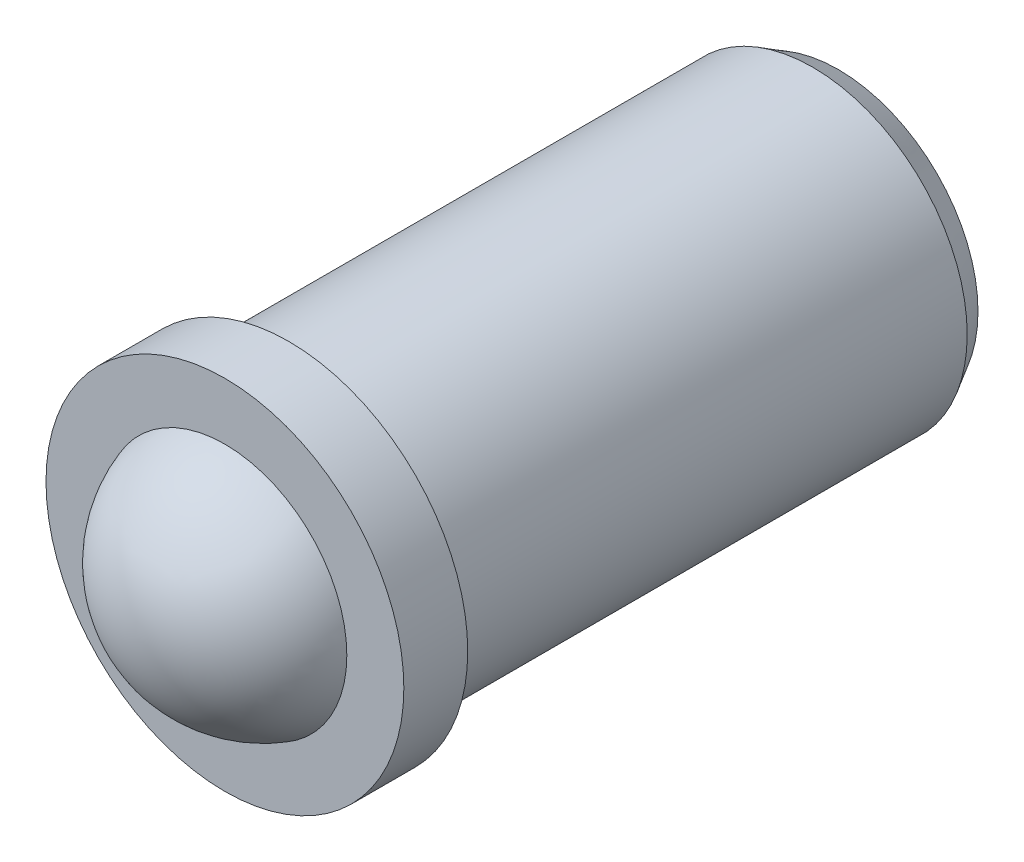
ISO-10303-21;
HEADER;
FILE_DESCRIPTION(('STEP AP214'),'2;1');
FILE_NAME('part.step','',(''),(''),'','','');
FILE_SCHEMA(('AUTOMOTIVE_DESIGN { 1 0 10303 214 1 1 1 1 }'));
ENDSEC;
DATA;
#1=APPLICATION_CONTEXT('core data for automotive mechanical design processes');
#2=APPLICATION_PROTOCOL_DEFINITION('international standard','automotive_design',2000,#1);
#3=PRODUCT_CONTEXT('',#1,'mechanical');
#4=PRODUCT('Part','Part','',(#3));
#5=PRODUCT_RELATED_PRODUCT_CATEGORY('part','',(#4));
#6=PRODUCT_DEFINITION_FORMATION('','',#4);
#7=PRODUCT_DEFINITION_CONTEXT('part definition',#1,'design');
#8=PRODUCT_DEFINITION('design','',#6,#7);
#9=PRODUCT_DEFINITION_SHAPE('','',#8);
#10=(LENGTH_UNIT() NAMED_UNIT(*) SI_UNIT(.MILLI.,.METRE.));
#11=(NAMED_UNIT(*) PLANE_ANGLE_UNIT() SI_UNIT($,.RADIAN.));
#12=(NAMED_UNIT(*) SI_UNIT($,.STERADIAN.) SOLID_ANGLE_UNIT());
#13=UNCERTAINTY_MEASURE_WITH_UNIT(LENGTH_MEASURE(1.E-05),#10,'distance_accuracy_value','');
#14=(GEOMETRIC_REPRESENTATION_CONTEXT(3) GLOBAL_UNCERTAINTY_ASSIGNED_CONTEXT((#13)) GLOBAL_UNIT_ASSIGNED_CONTEXT((#10,
#11,#12)) REPRESENTATION_CONTEXT('',''));
#15=CARTESIAN_POINT('',(0.,0.,0.));
#16=DIRECTION('',(0.,0.,1.));
#17=DIRECTION('',(1.,0.,0.));
#18=AXIS2_PLACEMENT_3D('',#15,#16,#17);
#19=CARTESIAN_POINT('',(0.,0.,-13.5));
#20=DIRECTION('',(0.,0.,-1.));
#21=DIRECTION('',(-1.,0.,0.));
#22=AXIS2_PLACEMENT_3D('',#19,#20,#21);
#23=CYLINDRICAL_SURFACE('',#22,6.04);
#24=CARTESIAN_POINT('',(0.,0.,0.));
#25=DIRECTION('',(0.,0.,-1.));
#26=DIRECTION('',(-1.,0.,0.));
#27=AXIS2_PLACEMENT_3D('',#24,#25,#26);
#28=CIRCLE('',#27,6.04);
#29=CARTESIAN_POINT('',(-6.04,0.,0.));
#30=VERTEX_POINT('',#29);
#31=EDGE_CURVE('E8',#30,#30,#28,.T.);
#32=ORIENTED_EDGE('',*,*,#31,.T.);
#33=EDGE_LOOP('',(#32));
#34=FACE_BOUND('',#33,.T.);
#35=CARTESIAN_POINT('',(0.,0.,-20.5));
#36=DIRECTION('',(0.,0.,1.));
#37=DIRECTION('',(1.,0.,0.));
#38=AXIS2_PLACEMENT_3D('',#35,#36,#37);
#39=CIRCLE('',#38,6.04);
#40=CARTESIAN_POINT('',(6.04,0.,-20.5));
#41=VERTEX_POINT('',#40);
#42=EDGE_CURVE('E31',#41,#41,#39,.T.);
#43=ORIENTED_EDGE('',*,*,#42,.T.);
#44=EDGE_LOOP('',(#43));
#45=FACE_BOUND('',#44,.T.);
#46=ADVANCED_FACE('F12',(#34,#45),#23,.T.);
#47=CARTESIAN_POINT('',(0.,-6.04,0.));
#48=DIRECTION('',(0.,0.,-1.));
#49=DIRECTION('',(-1.,0.,0.));
#50=AXIS2_PLACEMENT_3D('',#47,#48,#49);
#51=PLANE('',#50);
#52=CARTESIAN_POINT('',(0.,0.,0.));
#53=DIRECTION('',(0.,0.,-1.));
#54=DIRECTION('',(-1.,0.,0.));
#55=AXIS2_PLACEMENT_3D('',#52,#53,#54);
#56=CIRCLE('',#55,7.);
#57=CARTESIAN_POINT('',(-7.,0.,0.));
#58=VERTEX_POINT('',#57);
#59=EDGE_CURVE('E18',#58,#58,#56,.T.);
#60=ORIENTED_EDGE('',*,*,#59,.T.);
#61=EDGE_LOOP('',(#60));
#62=FACE_BOUND('',#61,.T.);
#63=ORIENTED_EDGE('',*,*,#31,.F.);
#64=EDGE_LOOP('',(#63));
#65=FACE_BOUND('',#64,.T.);
#66=ADVANCED_FACE('F52',(#62,#65),#51,.T.);
#67=CARTESIAN_POINT('',(0.,0.,-13.5));
#68=DIRECTION('',(0.,0.,-1.));
#69=DIRECTION('',(-1.,0.,0.));
#70=AXIS2_PLACEMENT_3D('',#67,#68,#69);
#71=CYLINDRICAL_SURFACE('',#70,7.);
#72=CARTESIAN_POINT('',(0.,0.,2.5));
#73=DIRECTION('',(0.,0.,-1.));
#74=DIRECTION('',(-1.,0.,0.));
#75=AXIS2_PLACEMENT_3D('',#72,#73,#74);
#76=CIRCLE('',#75,7.);
#77=CARTESIAN_POINT('',(-7.,0.,2.5));
#78=VERTEX_POINT('',#77);
#79=EDGE_CURVE('E22',#78,#78,#76,.T.);
#80=ORIENTED_EDGE('',*,*,#79,.T.);
#81=EDGE_LOOP('',(#80));
#82=FACE_BOUND('',#81,.T.);
#83=ORIENTED_EDGE('',*,*,#59,.F.);
#84=EDGE_LOOP('',(#83));
#85=FACE_BOUND('',#84,.T.);
#86=ADVANCED_FACE('F57',(#82,#85),#71,.T.);
#87=CARTESIAN_POINT('',(0.,-7.,2.5));
#88=DIRECTION('',(0.,0.,1.));
#89=DIRECTION('',(1.,0.,0.));
#90=AXIS2_PLACEMENT_3D('',#87,#88,#89);
#91=PLANE('',#90);
#92=CARTESIAN_POINT('',(0.,0.,2.5));
#93=DIRECTION('',(0.,0.,-1.));
#94=DIRECTION('',(-1.,0.,0.));
#95=AXIS2_PLACEMENT_3D('',#92,#93,#94);
#96=CIRCLE('',#95,4.76969600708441);
#97=CARTESIAN_POINT('',(-4.76969600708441,0.,2.5));
#98=VERTEX_POINT('',#97);
#99=EDGE_CURVE('E26',#98,#98,#96,.T.);
#100=ORIENTED_EDGE('',*,*,#99,.T.);
#101=EDGE_LOOP('',(#100));
#102=FACE_BOUND('',#101,.T.);
#103=ORIENTED_EDGE('',*,*,#79,.F.);
#104=EDGE_LOOP('',(#103));
#105=FACE_BOUND('',#104,.T.);
#106=ADVANCED_FACE('F64',(#102,#105),#91,.T.);
#107=CARTESIAN_POINT('',(0.,0.,0.999999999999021));
#108=DIRECTION('',(0.,0.,-1.));
#109=DIRECTION('',(0.,-1.,0.));
#110=AXIS2_PLACEMENT_3D('',#107,#108,#109);
#111=SPHERICAL_SURFACE('',#110,5.);
#112=ORIENTED_EDGE('',*,*,#99,.F.);
#113=EDGE_LOOP('',(#112));
#114=FACE_BOUND('',#113,.T.);
#115=ADVANCED_FACE('F48',(#114),#111,.T.);
#116=CARTESIAN_POINT('',(0.,0.,-21.5));
#117=DIRECTION('',(0.,0.,1.));
#118=DIRECTION('',(1.,0.,0.));
#119=AXIS2_PLACEMENT_3D('',#116,#117,#118);
#120=CONICAL_SURFACE('',#119,5.46264973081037,0.523598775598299);
#121=ORIENTED_EDGE('',*,*,#42,.F.);
#122=EDGE_LOOP('',(#121));
#123=FACE_BOUND('',#122,.T.);
#124=CARTESIAN_POINT('',(0.,0.,-21.5));
#125=DIRECTION('',(0.,0.,1.));
#126=DIRECTION('',(1.,0.,0.));
#127=AXIS2_PLACEMENT_3D('',#124,#125,#126);
#128=CIRCLE('',#127,5.46264973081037);
#129=CARTESIAN_POINT('',(5.46264973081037,0.,-21.5));
#130=VERTEX_POINT('',#129);
#131=EDGE_CURVE('E34',#130,#130,#128,.T.);
#132=ORIENTED_EDGE('',*,*,#131,.T.);
#133=EDGE_LOOP('',(#132));
#134=FACE_BOUND('',#133,.T.);
#135=ADVANCED_FACE('F38',(#123,#134),#120,.T.);
#136=CARTESIAN_POINT('',(-5.46264973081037,0.,-21.5));
#137=DIRECTION('',(0.,0.,1.));
#138=DIRECTION('',(1.,0.,0.));
#139=AXIS2_PLACEMENT_3D('',#136,#137,#138);
#140=PLANE('',#139);
#141=ORIENTED_EDGE('',*,*,#131,.F.);
#142=EDGE_LOOP('',(#141));
#143=FACE_BOUND('',#142,.T.);
#144=ADVANCED_FACE('F40',(#143),#140,.F.);
#145=CLOSED_SHELL('',(#46,#66,#86,#106,#115,#135,#144));
#146=MANIFOLD_SOLID_BREP('B1',#145);
#147=ADVANCED_BREP_SHAPE_REPRESENTATION('',(#18,#146),#14);
#148=SHAPE_DEFINITION_REPRESENTATION(#9,#147);
ENDSEC;
END-ISO-10303-21;
